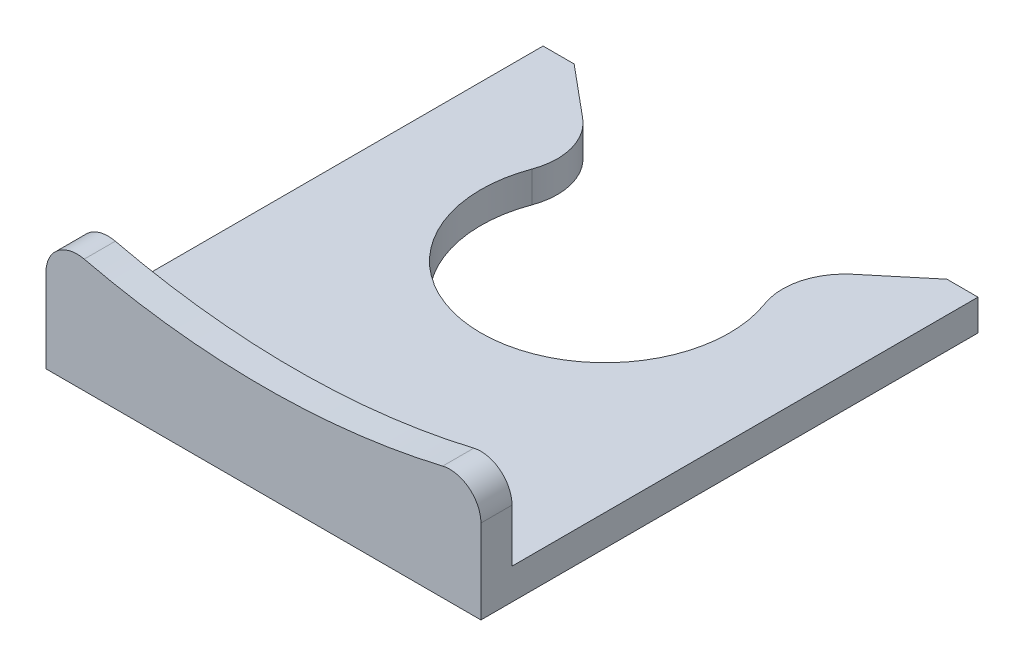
from build123d import *

# Parameters (mm, degrees)
EXTRUDE1_DEPTH = 1
EXTRUDE2_DEPTH = 1
FILLET1_R      = 1


with BuildPart() as part:
    # Sketch1 → Extrude1 (new body)
    with BuildSketch(Plane(origin=(0, 0, 0), x_dir=(1, 0, 0), z_dir=(0, 1, 0))):
        with BuildLine():
            Line((-7, 8), (-6, 8))
            Line((-6, 8), (-4.34571581, 6.621429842))
            ThreePointArc((-4.34571581, 6.621429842), (-3.693602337, 5.600266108), (-3.750723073, 4.389991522))
            ThreePointArc((-3.750723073, 4.389991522), (0, -1), (3.750723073, 4.389991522))
            ThreePointArc((3.750723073, 4.389991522), (3.693602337, 5.600266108), (4.34571581, 6.621429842))
            Line((4.34571581, 6.621429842), (6, 8))
            Line((6, 8), (7, 8))
            Line((7, 8), (7, -8))
            Line((7, -8), (-7, -8))
            Line((-7, -8), (-7, 8))
        make_face()
    extrude(amount=EXTRUDE1_DEPTH)

    # Sketch2 → Extrude2 (add)
    with BuildSketch(Plane.XY.offset(8)):
        with BuildLine():
            Line((-7, 0), (7, 0))
            Line((7, 0), (7, 4))
            ThreePointArc((7, 4), (0, 3), (-7, 4))
            Line((-7, 4), (-7, 0))
        make_face()
    extrude(amount=-EXTRUDE2_DEPTH)

    # Fillet1
    fillet1_edges = [part.edges().sort_by_distance(p)[0] for p in [
        (-7, 4, 7.5),
        (7, 4, 7.5),
    ]]
    fillet(fillet1_edges, radius=FILLET1_R)


solid = part.part
